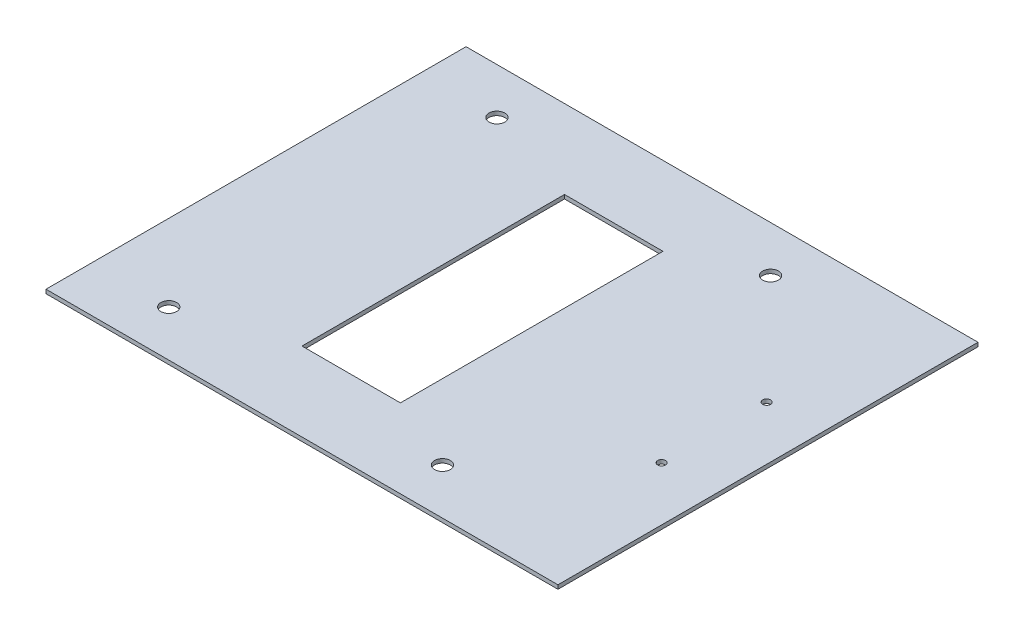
ISO-10303-21;
HEADER;
FILE_DESCRIPTION(('STEP AP214'),'2;1');
FILE_NAME('part.step','',(''),(''),'','','');
FILE_SCHEMA(('AUTOMOTIVE_DESIGN { 1 0 10303 214 1 1 1 1 }'));
ENDSEC;
DATA;
#1=APPLICATION_CONTEXT('core data for automotive mechanical design processes');
#2=APPLICATION_PROTOCOL_DEFINITION('international standard','automotive_design',2000,#1);
#3=PRODUCT_CONTEXT('',#1,'mechanical');
#4=PRODUCT('Part','Part','',(#3));
#5=PRODUCT_RELATED_PRODUCT_CATEGORY('part','',(#4));
#6=PRODUCT_DEFINITION_FORMATION('','',#4);
#7=PRODUCT_DEFINITION_CONTEXT('part definition',#1,'design');
#8=PRODUCT_DEFINITION('design','',#6,#7);
#9=PRODUCT_DEFINITION_SHAPE('','',#8);
#10=(LENGTH_UNIT() NAMED_UNIT(*) SI_UNIT(.MILLI.,.METRE.));
#11=(NAMED_UNIT(*) PLANE_ANGLE_UNIT() SI_UNIT($,.RADIAN.));
#12=(NAMED_UNIT(*) SI_UNIT($,.STERADIAN.) SOLID_ANGLE_UNIT());
#13=UNCERTAINTY_MEASURE_WITH_UNIT(LENGTH_MEASURE(1.E-05),#10,'distance_accuracy_value','');
#14=(GEOMETRIC_REPRESENTATION_CONTEXT(3) GLOBAL_UNCERTAINTY_ASSIGNED_CONTEXT((#13)) GLOBAL_UNIT_ASSIGNED_CONTEXT((#10,
#11,#12)) REPRESENTATION_CONTEXT('',''));
#15=CARTESIAN_POINT('',(0.,0.,0.));
#16=DIRECTION('',(0.,0.,1.));
#17=DIRECTION('',(1.,0.,0.));
#18=AXIS2_PLACEMENT_3D('',#15,#16,#17);
#19=CARTESIAN_POINT('',(0.,3.,-320.));
#20=DIRECTION('',(0.,0.,1.));
#21=DIRECTION('',(1.,0.,0.));
#22=AXIS2_PLACEMENT_3D('',#19,#20,#21);
#23=PLANE('',#22);
#24=DIRECTION('',(-1.,0.,0.));
#25=VECTOR('',#24,1.);
#26=CARTESIAN_POINT('',(0.,0.,-320.));
#27=LINE('',#26,#25);
#28=CARTESIAN_POINT('',(390.,0.,-320.));
#29=VERTEX_POINT('',#28);
#30=CARTESIAN_POINT('',(0.,0.,-320.));
#31=VERTEX_POINT('',#30);
#32=EDGE_CURVE('E116',#29,#31,#27,.T.);
#33=ORIENTED_EDGE('',*,*,#32,.T.);
#34=DIRECTION('',(0.,-1.,0.));
#35=VECTOR('',#34,1.);
#36=CARTESIAN_POINT('',(0.,3.,-320.));
#37=LINE('',#36,#35);
#38=CARTESIAN_POINT('',(0.,3.,-320.));
#39=VERTEX_POINT('',#38);
#40=EDGE_CURVE('E145',#39,#31,#37,.T.);
#41=ORIENTED_EDGE('',*,*,#40,.F.);
#42=DIRECTION('',(-1.,0.,0.));
#43=VECTOR('',#42,1.);
#44=CARTESIAN_POINT('',(0.,3.,-320.));
#45=LINE('',#44,#43);
#46=CARTESIAN_POINT('',(390.,3.,-320.));
#47=VERTEX_POINT('',#46);
#48=EDGE_CURVE('E127',#47,#39,#45,.T.);
#49=ORIENTED_EDGE('',*,*,#48,.F.);
#50=DIRECTION('',(0.,-1.,0.));
#51=VECTOR('',#50,1.);
#52=CARTESIAN_POINT('',(390.,3.,-320.));
#53=LINE('',#52,#51);
#54=EDGE_CURVE('E136',#47,#29,#53,.T.);
#55=ORIENTED_EDGE('',*,*,#54,.T.);
#56=EDGE_LOOP('',(#33,#41,#49,#55));
#57=FACE_BOUND('',#56,.T.);
#58=ADVANCED_FACE('F24',(#57),#23,.F.);
#59=CARTESIAN_POINT('',(0.,3.,0.));
#60=DIRECTION('',(1.,0.,0.));
#61=DIRECTION('',(0.,0.,-1.));
#62=AXIS2_PLACEMENT_3D('',#59,#60,#61);
#63=PLANE('',#62);
#64=DIRECTION('',(0.,0.,1.));
#65=VECTOR('',#64,1.);
#66=CARTESIAN_POINT('',(0.,0.,0.));
#67=LINE('',#66,#65);
#68=CARTESIAN_POINT('',(0.,0.,0.));
#69=VERTEX_POINT('',#68);
#70=EDGE_CURVE('E121',#31,#69,#67,.T.);
#71=ORIENTED_EDGE('',*,*,#70,.T.);
#72=DIRECTION('',(0.,-1.,0.));
#73=VECTOR('',#72,1.);
#74=CARTESIAN_POINT('',(0.,3.,0.));
#75=LINE('',#74,#73);
#76=CARTESIAN_POINT('',(0.,3.,0.));
#77=VERTEX_POINT('',#76);
#78=EDGE_CURVE('E142',#77,#69,#75,.T.);
#79=ORIENTED_EDGE('',*,*,#78,.F.);
#80=DIRECTION('',(0.,0.,1.));
#81=VECTOR('',#80,1.);
#82=CARTESIAN_POINT('',(0.,3.,0.));
#83=LINE('',#82,#81);
#84=EDGE_CURVE('E130',#39,#77,#83,.T.);
#85=ORIENTED_EDGE('',*,*,#84,.F.);
#86=ORIENTED_EDGE('',*,*,#40,.T.);
#87=EDGE_LOOP('',(#71,#79,#85,#86));
#88=FACE_BOUND('',#87,.T.);
#89=ADVANCED_FACE('F211',(#88),#63,.F.);
#90=CARTESIAN_POINT('',(0.,3.,0.));
#91=DIRECTION('',(0.,0.,-1.));
#92=DIRECTION('',(-1.,0.,0.));
#93=AXIS2_PLACEMENT_3D('',#90,#91,#92);
#94=PLANE('',#93);
#95=DIRECTION('',(1.,0.,0.));
#96=VECTOR('',#95,1.);
#97=CARTESIAN_POINT('',(0.,0.,0.));
#98=LINE('',#97,#96);
#99=CARTESIAN_POINT('',(390.,0.,0.));
#100=VERTEX_POINT('',#99);
#101=EDGE_CURVE('E123',#69,#100,#98,.T.);
#102=ORIENTED_EDGE('',*,*,#101,.T.);
#103=DIRECTION('',(0.,-1.,0.));
#104=VECTOR('',#103,1.);
#105=CARTESIAN_POINT('',(390.,3.,0.));
#106=LINE('',#105,#104);
#107=CARTESIAN_POINT('',(390.,3.,0.));
#108=VERTEX_POINT('',#107);
#109=EDGE_CURVE('E139',#108,#100,#106,.T.);
#110=ORIENTED_EDGE('',*,*,#109,.F.);
#111=DIRECTION('',(1.,0.,0.));
#112=VECTOR('',#111,1.);
#113=CARTESIAN_POINT('',(0.,3.,0.));
#114=LINE('',#113,#112);
#115=EDGE_CURVE('E132',#77,#108,#114,.T.);
#116=ORIENTED_EDGE('',*,*,#115,.F.);
#117=ORIENTED_EDGE('',*,*,#78,.T.);
#118=EDGE_LOOP('',(#102,#110,#116,#117));
#119=FACE_BOUND('',#118,.T.);
#120=ADVANCED_FACE('F205',(#119),#94,.F.);
#121=CARTESIAN_POINT('',(390.,3.,0.));
#122=DIRECTION('',(-1.,0.,0.));
#123=DIRECTION('',(0.,0.,1.));
#124=AXIS2_PLACEMENT_3D('',#121,#122,#123);
#125=PLANE('',#124);
#126=DIRECTION('',(0.,0.,-1.));
#127=VECTOR('',#126,1.);
#128=CARTESIAN_POINT('',(390.,0.,0.));
#129=LINE('',#128,#127);
#130=EDGE_CURVE('E125',#100,#29,#129,.T.);
#131=ORIENTED_EDGE('',*,*,#130,.T.);
#132=ORIENTED_EDGE('',*,*,#54,.F.);
#133=DIRECTION('',(0.,0.,-1.));
#134=VECTOR('',#133,1.);
#135=CARTESIAN_POINT('',(390.,3.,0.));
#136=LINE('',#135,#134);
#137=EDGE_CURVE('E134',#108,#47,#136,.T.);
#138=ORIENTED_EDGE('',*,*,#137,.F.);
#139=ORIENTED_EDGE('',*,*,#109,.T.);
#140=EDGE_LOOP('',(#131,#132,#138,#139));
#141=FACE_BOUND('',#140,.T.);
#142=ADVANCED_FACE('F195',(#141),#125,.F.);
#143=CARTESIAN_POINT('',(390.,3.,-320.));
#144=DIRECTION('',(0.,1.,0.));
#145=DIRECTION('',(0.,0.,1.));
#146=AXIS2_PLACEMENT_3D('',#143,#144,#145);
#147=PLANE('',#146);
#148=CARTESIAN_POINT('',(349.,3.,-120.));
#149=DIRECTION('',(0.,1.,0.));
#150=DIRECTION('',(0.,0.,1.));
#151=AXIS2_PLACEMENT_3D('',#148,#149,#150);
#152=CIRCLE('',#151,2.99999999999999);
#153=CARTESIAN_POINT('',(349.,3.,-117.));
#154=VERTEX_POINT('',#153);
#155=EDGE_CURVE('E180',#154,#154,#152,.T.);
#156=ORIENTED_EDGE('',*,*,#155,.F.);
#157=EDGE_LOOP('',(#156));
#158=FACE_BOUND('',#157,.T.);
#159=CARTESIAN_POINT('',(349.,3.,-200.));
#160=DIRECTION('',(0.,1.,0.));
#161=DIRECTION('',(0.,0.,1.));
#162=AXIS2_PLACEMENT_3D('',#159,#160,#161);
#163=CIRCLE('',#162,2.99999999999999);
#164=CARTESIAN_POINT('',(349.,3.,-197.));
#165=VERTEX_POINT('',#164);
#166=EDGE_CURVE('E170',#165,#165,#163,.T.);
#167=ORIENTED_EDGE('',*,*,#166,.F.);
#168=EDGE_LOOP('',(#167));
#169=FACE_BOUND('',#168,.T.);
#170=CARTESIAN_POINT('',(58.4999999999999,3.,-34.9999999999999));
#171=DIRECTION('',(0.,1.,0.));
#172=DIRECTION('',(0.,0.,1.));
#173=AXIS2_PLACEMENT_3D('',#170,#171,#172);
#174=CIRCLE('',#173,6.00000000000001);
#175=CARTESIAN_POINT('',(58.4999999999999,3.,-28.9999999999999));
#176=VERTEX_POINT('',#175);
#177=EDGE_CURVE('E167',#176,#176,#174,.T.);
#178=ORIENTED_EDGE('',*,*,#177,.F.);
#179=EDGE_LOOP('',(#178));
#180=FACE_BOUND('',#179,.T.);
#181=CARTESIAN_POINT('',(267.,3.,-34.9999999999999));
#182=DIRECTION('',(0.,1.,0.));
#183=DIRECTION('',(0.,0.,1.));
#184=AXIS2_PLACEMENT_3D('',#181,#182,#183);
#185=CIRCLE('',#184,5.99999999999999);
#186=CARTESIAN_POINT('',(267.,3.,-28.9999999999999));
#187=VERTEX_POINT('',#186);
#188=EDGE_CURVE('E164',#187,#187,#185,.T.);
#189=ORIENTED_EDGE('',*,*,#188,.F.);
#190=EDGE_LOOP('',(#189));
#191=FACE_BOUND('',#190,.T.);
#192=CARTESIAN_POINT('',(58.4999999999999,3.,-285.));
#193=DIRECTION('',(0.,1.,0.));
#194=DIRECTION('',(0.,0.,1.));
#195=AXIS2_PLACEMENT_3D('',#192,#193,#194);
#196=CIRCLE('',#195,6.00000000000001);
#197=CARTESIAN_POINT('',(58.4999999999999,3.,-279.));
#198=VERTEX_POINT('',#197);
#199=EDGE_CURVE('E160',#198,#198,#196,.T.);
#200=ORIENTED_EDGE('',*,*,#199,.F.);
#201=EDGE_LOOP('',(#200));
#202=FACE_BOUND('',#201,.T.);
#203=CARTESIAN_POINT('',(267.,3.,-285.));
#204=DIRECTION('',(0.,1.,0.));
#205=DIRECTION('',(0.,0.,1.));
#206=AXIS2_PLACEMENT_3D('',#203,#204,#205);
#207=CIRCLE('',#206,5.99999999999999);
#208=CARTESIAN_POINT('',(267.,3.,-279.));
#209=VERTEX_POINT('',#208);
#210=EDGE_CURVE('E156',#209,#209,#207,.T.);
#211=ORIENTED_EDGE('',*,*,#210,.F.);
#212=EDGE_LOOP('',(#211));
#213=FACE_BOUND('',#212,.T.);
#214=DIRECTION('',(0.,0.,1.));
#215=VECTOR('',#214,1.);
#216=CARTESIAN_POINT('',(135.,3.,-59.9999999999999));
#217=LINE('',#216,#215);
#218=CARTESIAN_POINT('',(135.,3.,-260.));
#219=VERTEX_POINT('',#218);
#220=CARTESIAN_POINT('',(135.,3.,-59.9999999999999));
#221=VERTEX_POINT('',#220);
#222=EDGE_CURVE('E40',#219,#221,#217,.T.);
#223=ORIENTED_EDGE('',*,*,#222,.F.);
#224=DIRECTION('',(-1.,0.,0.));
#225=VECTOR('',#224,1.);
#226=CARTESIAN_POINT('',(135.,3.,-260.));
#227=LINE('',#226,#225);
#228=CARTESIAN_POINT('',(210.,3.,-260.));
#229=VERTEX_POINT('',#228);
#230=EDGE_CURVE('E109',#229,#219,#227,.T.);
#231=ORIENTED_EDGE('',*,*,#230,.F.);
#232=DIRECTION('',(0.,0.,-1.));
#233=VECTOR('',#232,1.);
#234=CARTESIAN_POINT('',(210.,3.,-59.9999999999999));
#235=LINE('',#234,#233);
#236=CARTESIAN_POINT('',(210.,3.,-59.9999999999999));
#237=VERTEX_POINT('',#236);
#238=EDGE_CURVE('E93',#237,#229,#235,.T.);
#239=ORIENTED_EDGE('',*,*,#238,.F.);
#240=DIRECTION('',(1.,0.,0.));
#241=VECTOR('',#240,1.);
#242=CARTESIAN_POINT('',(135.,3.,-59.9999999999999));
#243=LINE('',#242,#241);
#244=EDGE_CURVE('E102',#221,#237,#243,.T.);
#245=ORIENTED_EDGE('',*,*,#244,.F.);
#246=EDGE_LOOP('',(#223,#231,#239,#245));
#247=FACE_BOUND('',#246,.T.);
#248=ORIENTED_EDGE('',*,*,#48,.T.);
#249=ORIENTED_EDGE('',*,*,#84,.T.);
#250=ORIENTED_EDGE('',*,*,#115,.T.);
#251=ORIENTED_EDGE('',*,*,#137,.T.);
#252=EDGE_LOOP('',(#248,#249,#250,#251));
#253=FACE_BOUND('',#252,.T.);
#254=ADVANCED_FACE('F106',(#158,#169,#180,#191,#202,#213,#247,#253),#147,.T.);
#255=CARTESIAN_POINT('',(390.,0.,-320.));
#256=DIRECTION('',(0.,1.,0.));
#257=DIRECTION('',(0.,0.,1.));
#258=AXIS2_PLACEMENT_3D('',#255,#256,#257);
#259=PLANE('',#258);
#260=CARTESIAN_POINT('',(349.,0.,-120.));
#261=DIRECTION('',(0.,1.,0.));
#262=DIRECTION('',(0.,0.,1.));
#263=AXIS2_PLACEMENT_3D('',#260,#261,#262);
#264=CIRCLE('',#263,2.99999999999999);
#265=CARTESIAN_POINT('',(349.,0.,-117.));
#266=VERTEX_POINT('',#265);
#267=EDGE_CURVE('E27',#266,#266,#264,.T.);
#268=ORIENTED_EDGE('',*,*,#267,.T.);
#269=EDGE_LOOP('',(#268));
#270=FACE_BOUND('',#269,.T.);
#271=CARTESIAN_POINT('',(349.,0.,-200.));
#272=DIRECTION('',(0.,1.,0.));
#273=DIRECTION('',(0.,0.,1.));
#274=AXIS2_PLACEMENT_3D('',#271,#272,#273);
#275=CIRCLE('',#274,2.99999999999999);
#276=CARTESIAN_POINT('',(349.,0.,-197.));
#277=VERTEX_POINT('',#276);
#278=EDGE_CURVE('E168',#277,#277,#275,.T.);
#279=ORIENTED_EDGE('',*,*,#278,.T.);
#280=EDGE_LOOP('',(#279));
#281=FACE_BOUND('',#280,.T.);
#282=CARTESIAN_POINT('',(58.4999999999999,0.,-34.9999999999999));
#283=DIRECTION('',(0.,1.,0.));
#284=DIRECTION('',(0.,0.,1.));
#285=AXIS2_PLACEMENT_3D('',#282,#283,#284);
#286=CIRCLE('',#285,6.00000000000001);
#287=CARTESIAN_POINT('',(58.4999999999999,0.,-28.9999999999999));
#288=VERTEX_POINT('',#287);
#289=EDGE_CURVE('E165',#288,#288,#286,.T.);
#290=ORIENTED_EDGE('',*,*,#289,.T.);
#291=EDGE_LOOP('',(#290));
#292=FACE_BOUND('',#291,.T.);
#293=CARTESIAN_POINT('',(267.,0.,-34.9999999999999));
#294=DIRECTION('',(0.,1.,0.));
#295=DIRECTION('',(0.,0.,1.));
#296=AXIS2_PLACEMENT_3D('',#293,#294,#295);
#297=CIRCLE('',#296,5.99999999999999);
#298=CARTESIAN_POINT('',(267.,0.,-28.9999999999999));
#299=VERTEX_POINT('',#298);
#300=EDGE_CURVE('E161',#299,#299,#297,.T.);
#301=ORIENTED_EDGE('',*,*,#300,.T.);
#302=EDGE_LOOP('',(#301));
#303=FACE_BOUND('',#302,.T.);
#304=CARTESIAN_POINT('',(58.4999999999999,0.,-285.));
#305=DIRECTION('',(0.,1.,0.));
#306=DIRECTION('',(0.,0.,1.));
#307=AXIS2_PLACEMENT_3D('',#304,#305,#306);
#308=CIRCLE('',#307,6.00000000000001);
#309=CARTESIAN_POINT('',(58.4999999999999,0.,-279.));
#310=VERTEX_POINT('',#309);
#311=EDGE_CURVE('E157',#310,#310,#308,.T.);
#312=ORIENTED_EDGE('',*,*,#311,.T.);
#313=EDGE_LOOP('',(#312));
#314=FACE_BOUND('',#313,.T.);
#315=CARTESIAN_POINT('',(267.,0.,-285.));
#316=DIRECTION('',(0.,1.,0.));
#317=DIRECTION('',(0.,0.,1.));
#318=AXIS2_PLACEMENT_3D('',#315,#316,#317);
#319=CIRCLE('',#318,5.99999999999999);
#320=CARTESIAN_POINT('',(267.,0.,-279.));
#321=VERTEX_POINT('',#320);
#322=EDGE_CURVE('E153',#321,#321,#319,.T.);
#323=ORIENTED_EDGE('',*,*,#322,.T.);
#324=EDGE_LOOP('',(#323));
#325=FACE_BOUND('',#324,.T.);
#326=DIRECTION('',(-1.,0.,0.));
#327=VECTOR('',#326,1.);
#328=CARTESIAN_POINT('',(390.,0.,-260.));
#329=LINE('',#328,#327);
#330=CARTESIAN_POINT('',(210.,0.,-260.));
#331=VERTEX_POINT('',#330);
#332=CARTESIAN_POINT('',(135.,0.,-260.));
#333=VERTEX_POINT('',#332);
#334=EDGE_CURVE('E32',#331,#333,#329,.T.);
#335=ORIENTED_EDGE('',*,*,#334,.T.);
#336=DIRECTION('',(0.,0.,1.));
#337=VECTOR('',#336,1.);
#338=CARTESIAN_POINT('',(135.,0.,-320.));
#339=LINE('',#338,#337);
#340=CARTESIAN_POINT('',(135.,0.,-59.9999999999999));
#341=VERTEX_POINT('',#340);
#342=EDGE_CURVE('E11',#333,#341,#339,.T.);
#343=ORIENTED_EDGE('',*,*,#342,.T.);
#344=DIRECTION('',(1.,0.,0.));
#345=VECTOR('',#344,1.);
#346=CARTESIAN_POINT('',(390.,0.,-59.9999999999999));
#347=LINE('',#346,#345);
#348=CARTESIAN_POINT('',(210.,0.,-59.9999999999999));
#349=VERTEX_POINT('',#348);
#350=EDGE_CURVE('E148',#341,#349,#347,.T.);
#351=ORIENTED_EDGE('',*,*,#350,.T.);
#352=DIRECTION('',(0.,0.,-1.));
#353=VECTOR('',#352,1.);
#354=CARTESIAN_POINT('',(210.,0.,-320.));
#355=LINE('',#354,#353);
#356=EDGE_CURVE('E96',#349,#331,#355,.T.);
#357=ORIENTED_EDGE('',*,*,#356,.T.);
#358=EDGE_LOOP('',(#335,#343,#351,#357));
#359=FACE_BOUND('',#358,.T.);
#360=ORIENTED_EDGE('',*,*,#32,.F.);
#361=ORIENTED_EDGE('',*,*,#130,.F.);
#362=ORIENTED_EDGE('',*,*,#101,.F.);
#363=ORIENTED_EDGE('',*,*,#70,.F.);
#364=EDGE_LOOP('',(#360,#361,#362,#363));
#365=FACE_BOUND('',#364,.T.);
#366=ADVANCED_FACE('F194',(#270,#281,#292,#303,#314,#325,#359,#365),#259,.F.);
#367=CARTESIAN_POINT('',(135.,-1.,-59.9999999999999));
#368=DIRECTION('',(-1.,0.,0.));
#369=DIRECTION('',(0.,0.,1.));
#370=AXIS2_PLACEMENT_3D('',#367,#368,#369);
#371=PLANE('',#370);
#372=DIRECTION('',(0.,1.,0.));
#373=VECTOR('',#372,1.);
#374=CARTESIAN_POINT('',(135.,-1.,-260.));
#375=LINE('',#374,#373);
#376=EDGE_CURVE('E114',#333,#219,#375,.T.);
#377=ORIENTED_EDGE('',*,*,#376,.T.);
#378=ORIENTED_EDGE('',*,*,#222,.T.);
#379=DIRECTION('',(0.,1.,0.));
#380=VECTOR('',#379,1.);
#381=CARTESIAN_POINT('',(135.,-1.,-59.9999999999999));
#382=LINE('',#381,#380);
#383=EDGE_CURVE('E99',#341,#221,#382,.T.);
#384=ORIENTED_EDGE('',*,*,#383,.F.);
#385=ORIENTED_EDGE('',*,*,#342,.F.);
#386=EDGE_LOOP('',(#377,#378,#384,#385));
#387=FACE_BOUND('',#386,.T.);
#388=ADVANCED_FACE('F202',(#387),#371,.F.);
#389=CARTESIAN_POINT('',(135.,-1.,-260.));
#390=DIRECTION('',(0.,0.,-1.));
#391=DIRECTION('',(-1.,0.,0.));
#392=AXIS2_PLACEMENT_3D('',#389,#390,#391);
#393=PLANE('',#392);
#394=DIRECTION('',(0.,1.,0.));
#395=VECTOR('',#394,1.);
#396=CARTESIAN_POINT('',(210.,-1.,-260.));
#397=LINE('',#396,#395);
#398=EDGE_CURVE('E98',#331,#229,#397,.T.);
#399=ORIENTED_EDGE('',*,*,#398,.T.);
#400=ORIENTED_EDGE('',*,*,#230,.T.);
#401=ORIENTED_EDGE('',*,*,#376,.F.);
#402=ORIENTED_EDGE('',*,*,#334,.F.);
#403=EDGE_LOOP('',(#399,#400,#401,#402));
#404=FACE_BOUND('',#403,.T.);
#405=ADVANCED_FACE('F256',(#404),#393,.F.);
#406=CARTESIAN_POINT('',(210.,-1.,-59.9999999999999));
#407=DIRECTION('',(1.,0.,0.));
#408=DIRECTION('',(0.,0.,-1.));
#409=AXIS2_PLACEMENT_3D('',#406,#407,#408);
#410=PLANE('',#409);
#411=DIRECTION('',(0.,1.,0.));
#412=VECTOR('',#411,1.);
#413=CARTESIAN_POINT('',(210.,-1.,-59.9999999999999));
#414=LINE('',#413,#412);
#415=EDGE_CURVE('E48',#349,#237,#414,.T.);
#416=ORIENTED_EDGE('',*,*,#415,.T.);
#417=ORIENTED_EDGE('',*,*,#238,.T.);
#418=ORIENTED_EDGE('',*,*,#398,.F.);
#419=ORIENTED_EDGE('',*,*,#356,.F.);
#420=EDGE_LOOP('',(#416,#417,#418,#419));
#421=FACE_BOUND('',#420,.T.);
#422=ADVANCED_FACE('F90',(#421),#410,.F.);
#423=CARTESIAN_POINT('',(135.,-1.,-59.9999999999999));
#424=DIRECTION('',(0.,0.,1.));
#425=DIRECTION('',(1.,0.,0.));
#426=AXIS2_PLACEMENT_3D('',#423,#424,#425);
#427=PLANE('',#426);
#428=ORIENTED_EDGE('',*,*,#383,.T.);
#429=ORIENTED_EDGE('',*,*,#244,.T.);
#430=ORIENTED_EDGE('',*,*,#415,.F.);
#431=ORIENTED_EDGE('',*,*,#350,.F.);
#432=EDGE_LOOP('',(#428,#429,#430,#431));
#433=FACE_BOUND('',#432,.T.);
#434=ADVANCED_FACE('F103',(#433),#427,.F.);
#435=CARTESIAN_POINT('',(267.,-1.,-285.));
#436=DIRECTION('',(0.,1.,0.));
#437=DIRECTION('',(0.,0.,1.));
#438=AXIS2_PLACEMENT_3D('',#435,#436,#437);
#439=CYLINDRICAL_SURFACE('',#438,5.99999999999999);
#440=ORIENTED_EDGE('',*,*,#210,.T.);
#441=EDGE_LOOP('',(#440));
#442=FACE_BOUND('',#441,.T.);
#443=ORIENTED_EDGE('',*,*,#322,.F.);
#444=EDGE_LOOP('',(#443));
#445=FACE_BOUND('',#444,.T.);
#446=ADVANCED_FACE('F190',(#442,#445),#439,.F.);
#447=CARTESIAN_POINT('',(58.4999999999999,-1.,-285.));
#448=DIRECTION('',(0.,1.,0.));
#449=DIRECTION('',(0.,0.,1.));
#450=AXIS2_PLACEMENT_3D('',#447,#448,#449);
#451=CYLINDRICAL_SURFACE('',#450,6.00000000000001);
#452=ORIENTED_EDGE('',*,*,#199,.T.);
#453=EDGE_LOOP('',(#452));
#454=FACE_BOUND('',#453,.T.);
#455=ORIENTED_EDGE('',*,*,#311,.F.);
#456=EDGE_LOOP('',(#455));
#457=FACE_BOUND('',#456,.T.);
#458=ADVANCED_FACE('F281',(#454,#457),#451,.F.);
#459=CARTESIAN_POINT('',(267.,-1.,-34.9999999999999));
#460=DIRECTION('',(0.,1.,0.));
#461=DIRECTION('',(0.,0.,1.));
#462=AXIS2_PLACEMENT_3D('',#459,#460,#461);
#463=CYLINDRICAL_SURFACE('',#462,5.99999999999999);
#464=ORIENTED_EDGE('',*,*,#188,.T.);
#465=EDGE_LOOP('',(#464));
#466=FACE_BOUND('',#465,.T.);
#467=ORIENTED_EDGE('',*,*,#300,.F.);
#468=EDGE_LOOP('',(#467));
#469=FACE_BOUND('',#468,.T.);
#470=ADVANCED_FACE('F288',(#466,#469),#463,.F.);
#471=CARTESIAN_POINT('',(58.4999999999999,-1.,-34.9999999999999));
#472=DIRECTION('',(0.,1.,0.));
#473=DIRECTION('',(0.,0.,1.));
#474=AXIS2_PLACEMENT_3D('',#471,#472,#473);
#475=CYLINDRICAL_SURFACE('',#474,6.00000000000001);
#476=ORIENTED_EDGE('',*,*,#177,.T.);
#477=EDGE_LOOP('',(#476));
#478=FACE_BOUND('',#477,.T.);
#479=ORIENTED_EDGE('',*,*,#289,.F.);
#480=EDGE_LOOP('',(#479));
#481=FACE_BOUND('',#480,.T.);
#482=ADVANCED_FACE('F296',(#478,#481),#475,.F.);
#483=CARTESIAN_POINT('',(349.,-7.,-200.));
#484=DIRECTION('',(0.,1.,0.));
#485=DIRECTION('',(0.,0.,1.));
#486=AXIS2_PLACEMENT_3D('',#483,#484,#485);
#487=CYLINDRICAL_SURFACE('',#486,2.99999999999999);
#488=ORIENTED_EDGE('',*,*,#166,.T.);
#489=EDGE_LOOP('',(#488));
#490=FACE_BOUND('',#489,.T.);
#491=ORIENTED_EDGE('',*,*,#278,.F.);
#492=EDGE_LOOP('',(#491));
#493=FACE_BOUND('',#492,.T.);
#494=ADVANCED_FACE('F304',(#490,#493),#487,.F.);
#495=CARTESIAN_POINT('',(349.,-7.,-120.));
#496=DIRECTION('',(0.,1.,0.));
#497=DIRECTION('',(0.,0.,1.));
#498=AXIS2_PLACEMENT_3D('',#495,#496,#497);
#499=CYLINDRICAL_SURFACE('',#498,2.99999999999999);
#500=ORIENTED_EDGE('',*,*,#155,.T.);
#501=EDGE_LOOP('',(#500));
#502=FACE_BOUND('',#501,.T.);
#503=ORIENTED_EDGE('',*,*,#267,.F.);
#504=EDGE_LOOP('',(#503));
#505=FACE_BOUND('',#504,.T.);
#506=ADVANCED_FACE('F312',(#502,#505),#499,.F.);
#507=CLOSED_SHELL('',(#58,#89,#120,#142,#254,#366,#388,#405,#422,#434,#446,#458,#470,#482,#494,#506));
#508=MANIFOLD_SOLID_BREP('B2',#507);
#509=ADVANCED_BREP_SHAPE_REPRESENTATION('',(#18,#508),#14);
#510=SHAPE_DEFINITION_REPRESENTATION(#9,#509);
ENDSEC;
END-ISO-10303-21;
